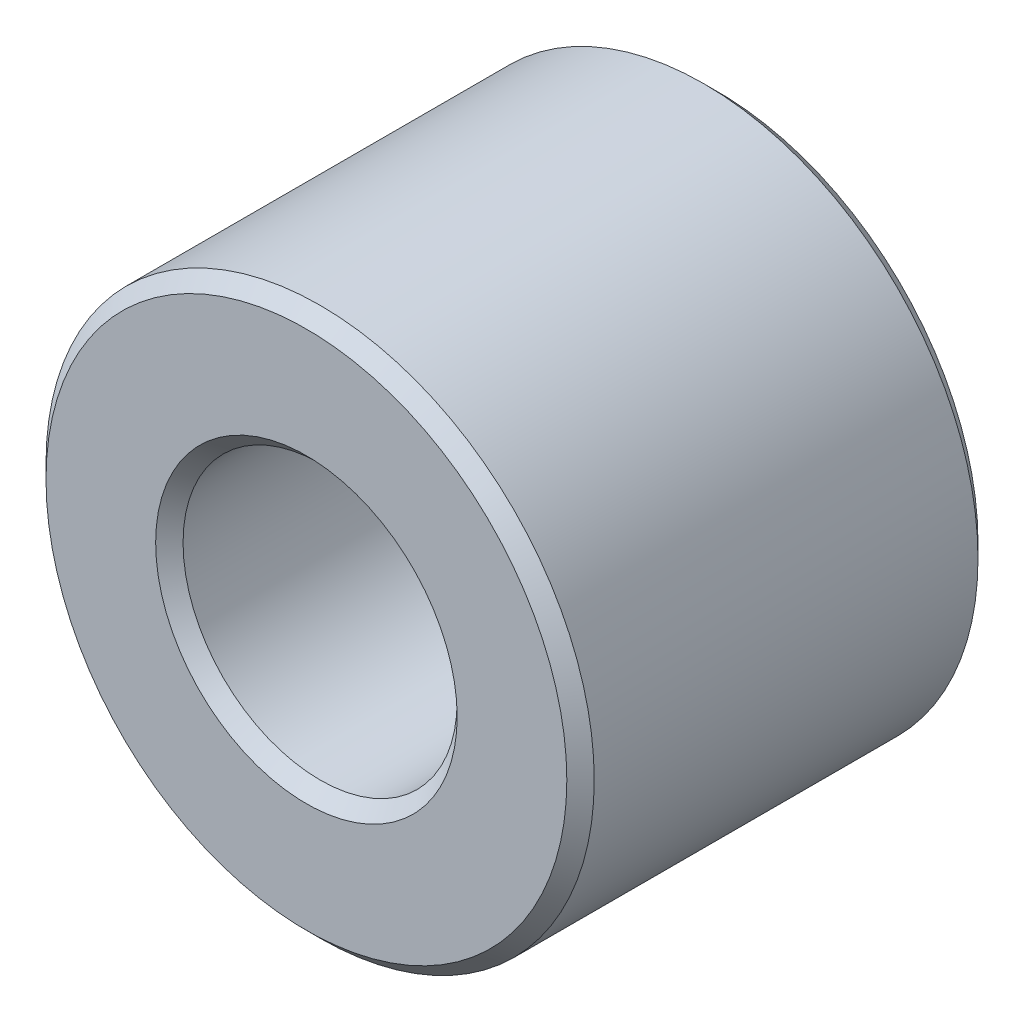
from build123d import *

# Parameters (mm, degrees)
SKETCH1_R           = 30
SKETCH1_R_2         = 15
BOSS_EXTRUDE1_DEPTH = 22.5
CHAMFER1_SIZE       = 1.5


with BuildPart() as part:
    # Sketch1 → Boss-Extrude1 (new, symmetric)
    with BuildSketch(Plane.XY):
        with Locations(Location((0, 0, 0), (0, 0, 180))):
            Circle(SKETCH1_R)
        with Locations(Location((0, 0, 0), (0, 0, 180))):
            Circle(SKETCH1_R_2, mode=Mode.SUBTRACT)
    extrude(amount=BOSS_EXTRUDE1_DEPTH, both=True)

    # Chamfer1
    chamfer1_edges = [part.edges().sort_by_distance(p)[0] for p in [
        (30, 0, -22.5),
        (30, 0, 22.5),
        (15, 0, -22.5),
        (15, 0, 22.5),
    ]]
    chamfer(chamfer1_edges, length=CHAMFER1_SIZE)


solid = part.part
